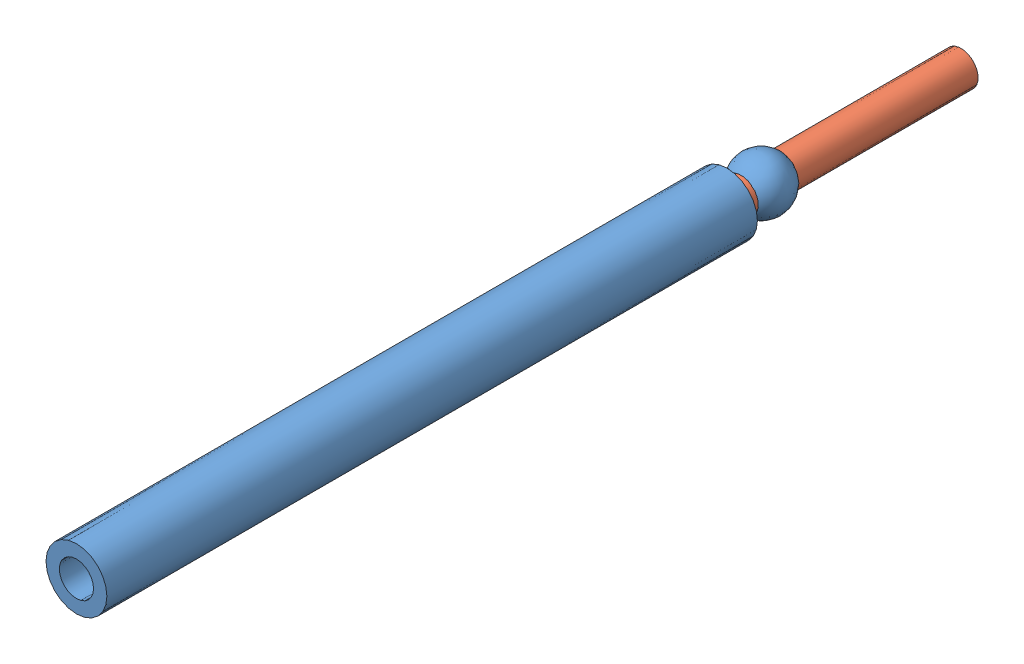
SolidWorks assembly Leg.SLDASM, configuration ﾃﾞﾌｫﾙﾄ (file format 4400). Lengths in mm.
Overall size (91.75 91.75 1162.61).
2 component instances, 2 part files, 1 mates.
Components (placement in the parent):
- Lowerleg-1: Lowerleg.SLDPRT [ﾃﾞﾌｫﾙﾄ] at (-38.3019 -11.6197 -232.5) size (80 80 935)
- Upperleg-1: Upperleg.SLDPRT [ﾃﾞﾌｫﾙﾄ] at (-38.3019 -11.6197 549.8873) x (-0.389728 0.92093 0) z (0 0 -1) size (70 70 1080)
Mates (geometry in assembly coordinates):
- 同心円1: concentric aligned: cylinder of Upperleg-1 through (-38.3019 -11.6197 -495.1127) axis (0 0 1) radius 22.5; cylinder of Lowerleg-1 through (-38.3019 -11.6197 217.5) axis (0 0 1) radius 22.5
